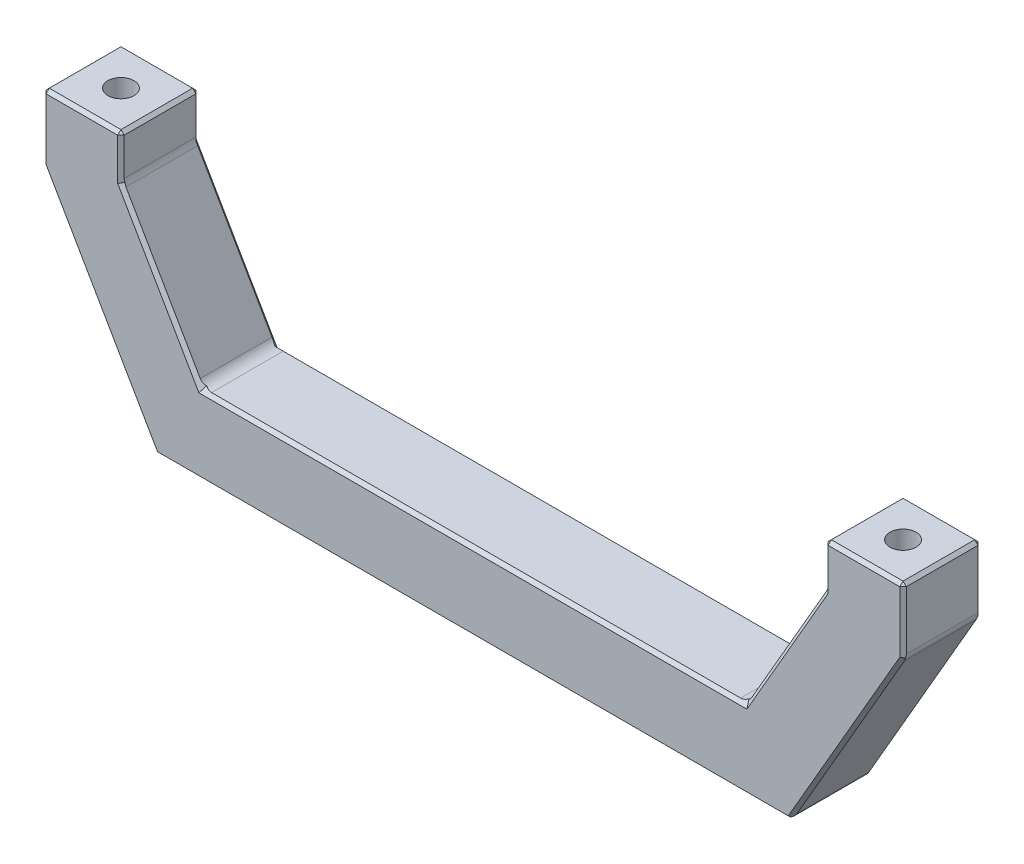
from build123d import *

# Parameters (mm, degrees)
AUFSATZ_LINEAR_AUSTRAGEN1_DEPTH = 6
FASE1_SIZE                      = 0.5
VERRUNDUNG1_R                   = 2
SKIZZE2_R                       = 2
SCHNITT_LINEAR_AUSTRAGEN1_DEPTH = 7


with BuildPart() as part:
    # Skizze1 → Aufsatz-Linear austragen1 (new, symmetric)
    with BuildSketch(Plane.XY):
        Polygon((-66, 40), (-66, 30), (-48.679491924, 0), (48.679491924, 0), (66, 30), (66, 40), (54, 40), (54, 33.215390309), (41.751288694, 12), (-41.751288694, 12), (-54, 33.215390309), (-54, 40), align=None)
    extrude(amount=AUFSATZ_LINEAR_AUSTRAGEN1_DEPTH, both=True)

    # Fase1
    fase1_edges = [part.edges().sort_by_distance(p)[0] for p in [
        (-54, 36.607695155, -6),
        (-47.875644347, 22.607695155, -6),
        (-57.339745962, 15, 6),
        (0, 12, -6),
        (47.875644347, 22.607695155, -6),
        (54, 36.607695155, -6),
        (60, 40, -6),
        (66, 35, -6),
        (57.339745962, 15, -6),
        (0, 0, -6),
        (-57.339745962, 15, -6),
        (-66, 35, -6),
        (-60, 40, -6),
        (0, 0, 6),
        (-54, 40, 0),
        (57.339745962, 15, 6),
        (54, 40, 0),
        (66, 40, 0),
        (-66, 40, 0),
        (66, 35, 6),
        (60, 40, 6),
        (54, 36.607695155, 6),
        (47.875644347, 22.607695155, 6),
        (0, 12, 6),
        (-47.875644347, 22.607695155, 6),
        (-54, 36.607695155, 6),
        (-60, 40, 6),
        (-66, 35, 6),
    ]]
    chamfer(fase1_edges, length=FASE1_SIZE)

    # Verrundung1
    verrundung1_edges = [part.edges().sort_by_distance(p)[0] for p in [
        (-54, 33.215390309, 0),
        (-41.751288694, 12, 0),
        (41.751288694, 12, 0),
        (54, 33.215390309, 0),
        (66, 30, 0),
        (48.679491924, 0, 0),
        (-48.679491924, 0, 0),
        (-66, 30, 0),
    ]]
    fillet(verrundung1_edges, radius=VERRUNDUNG1_R)

    # Skizze2 → Schnitt-Linear austragen1 (cut)
    with BuildSketch(Plane(origin=(0, 40, 0), x_dir=(1, 0, 0), z_dir=(0, 1, 0))):
        with Locations(Location((-60, 0, 0), (0, 0, 180))):
            Circle(SKIZZE2_R)
        with Locations(Location((60, 0, 0), (0, 0, 180))):
            Circle(SKIZZE2_R)
    extrude(amount=-SCHNITT_LINEAR_AUSTRAGEN1_DEPTH, mode=Mode.SUBTRACT)


solid = part.part
